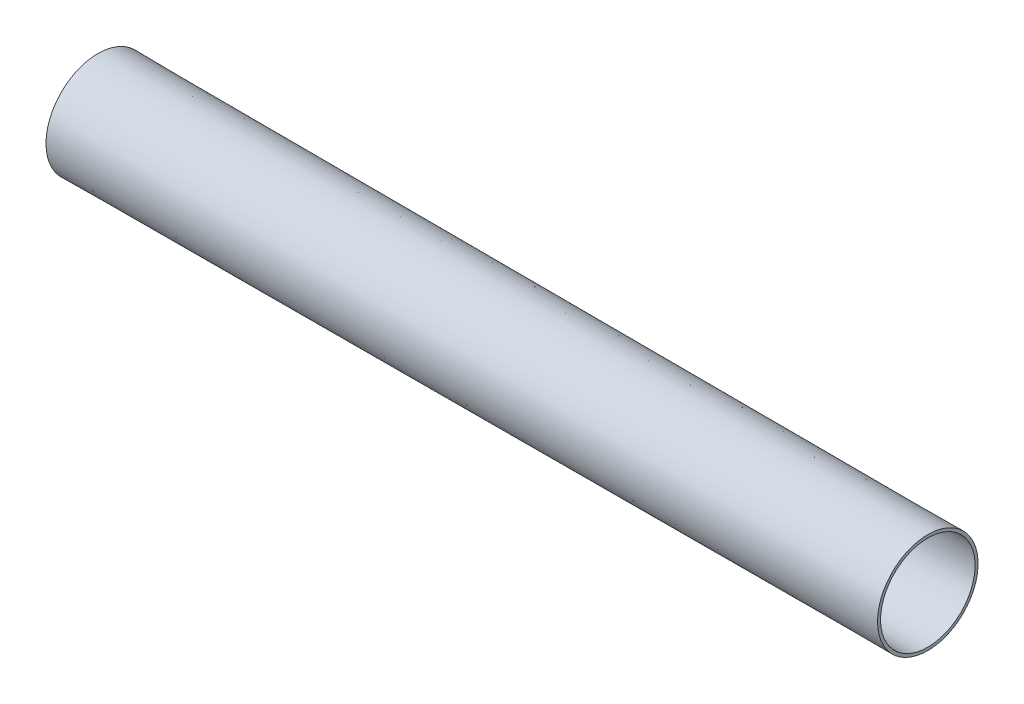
ISO-10303-21;
HEADER;
FILE_DESCRIPTION(('STEP AP214'),'2;1');
FILE_NAME('part.step','',(''),(''),'','','');
FILE_SCHEMA(('AUTOMOTIVE_DESIGN { 1 0 10303 214 1 1 1 1 }'));
ENDSEC;
DATA;
#1=APPLICATION_CONTEXT('core data for automotive mechanical design processes');
#2=APPLICATION_PROTOCOL_DEFINITION('international standard','automotive_design',2000,#1);
#3=PRODUCT_CONTEXT('',#1,'mechanical');
#4=PRODUCT('Part','Part','',(#3));
#5=PRODUCT_RELATED_PRODUCT_CATEGORY('part','',(#4));
#6=PRODUCT_DEFINITION_FORMATION('','',#4);
#7=PRODUCT_DEFINITION_CONTEXT('part definition',#1,'design');
#8=PRODUCT_DEFINITION('design','',#6,#7);
#9=PRODUCT_DEFINITION_SHAPE('','',#8);
#10=(LENGTH_UNIT() NAMED_UNIT(*) SI_UNIT(.MILLI.,.METRE.));
#11=(NAMED_UNIT(*) PLANE_ANGLE_UNIT() SI_UNIT($,.RADIAN.));
#12=(NAMED_UNIT(*) SI_UNIT($,.STERADIAN.) SOLID_ANGLE_UNIT());
#13=UNCERTAINTY_MEASURE_WITH_UNIT(LENGTH_MEASURE(1.E-05),#10,'distance_accuracy_value','');
#14=(GEOMETRIC_REPRESENTATION_CONTEXT(3) GLOBAL_UNCERTAINTY_ASSIGNED_CONTEXT((#13)) GLOBAL_UNIT_ASSIGNED_CONTEXT((#10,
#11,#12)) REPRESENTATION_CONTEXT('',''));
#15=CARTESIAN_POINT('',(0.,0.,0.));
#16=DIRECTION('',(0.,0.,1.));
#17=DIRECTION('',(1.,0.,0.));
#18=AXIS2_PLACEMENT_3D('',#15,#16,#17);
#19=CARTESIAN_POINT('',(19.05,0.,0.));
#20=DIRECTION('',(-1.,0.,0.));
#21=DIRECTION('',(0.,0.,1.));
#22=AXIS2_PLACEMENT_3D('',#19,#20,#21);
#23=CONICAL_SURFACE('',#22,16.4973,0.00206060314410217);
#24=CARTESIAN_POINT('',(298.45,0.,0.));
#25=DIRECTION('',(-1.,0.,0.));
#26=DIRECTION('',(0.,0.,1.));
#27=AXIS2_PLACEMENT_3D('',#24,#25,#26);
#28=CIRCLE('',#27,15.9215666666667);
#29=CARTESIAN_POINT('',(298.45,0.,15.9215666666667));
#30=VERTEX_POINT('',#29);
#31=EDGE_CURVE('E10',#30,#30,#28,.T.);
#32=ORIENTED_EDGE('',*,*,#31,.F.);
#33=EDGE_LOOP('',(#32));
#34=FACE_BOUND('',#33,.T.);
#35=CARTESIAN_POINT('',(19.05,0.,0.));
#36=DIRECTION('',(-1.,0.,0.));
#37=DIRECTION('',(0.,0.,1.));
#38=AXIS2_PLACEMENT_3D('',#35,#36,#37);
#39=CIRCLE('',#38,16.4973);
#40=CARTESIAN_POINT('',(19.05,0.,16.4973));
#41=VERTEX_POINT('',#40);
#42=EDGE_CURVE('E47',#41,#41,#39,.T.);
#43=ORIENTED_EDGE('',*,*,#42,.T.);
#44=EDGE_LOOP('',(#43));
#45=FACE_BOUND('',#44,.T.);
#46=ADVANCED_FACE('F33',(#34,#45),#23,.F.);
#47=CARTESIAN_POINT('',(298.45,15.9215666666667,0.));
#48=DIRECTION('',(-1.,0.,0.));
#49=DIRECTION('',(0.,0.,1.));
#50=AXIS2_PLACEMENT_3D('',#47,#48,#49);
#51=PLANE('',#50);
#52=CARTESIAN_POINT('',(298.45,0.,0.));
#53=DIRECTION('',(-1.,0.,0.));
#54=DIRECTION('',(0.,0.,1.));
#55=AXIS2_PLACEMENT_3D('',#52,#53,#54);
#56=CIRCLE('',#55,16.9291);
#57=CARTESIAN_POINT('',(298.45,0.,16.9291));
#58=VERTEX_POINT('',#57);
#59=EDGE_CURVE('E39',#58,#58,#56,.T.);
#60=ORIENTED_EDGE('',*,*,#59,.F.);
#61=EDGE_LOOP('',(#60));
#62=FACE_BOUND('',#61,.T.);
#63=ORIENTED_EDGE('',*,*,#31,.T.);
#64=EDGE_LOOP('',(#63));
#65=FACE_BOUND('',#64,.T.);
#66=ADVANCED_FACE('F62',(#62,#65),#51,.F.);
#67=CARTESIAN_POINT('',(298.45,0.,0.));
#68=DIRECTION('',(-1.,0.,0.));
#69=DIRECTION('',(0.,0.,1.));
#70=AXIS2_PLACEMENT_3D('',#67,#68,#69);
#71=CONICAL_SURFACE('',#70,16.9291,0.00206060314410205);
#72=CARTESIAN_POINT('',(19.05,0.,0.));
#73=DIRECTION('',(-1.,0.,0.));
#74=DIRECTION('',(0.,0.,1.));
#75=AXIS2_PLACEMENT_3D('',#72,#73,#74);
#76=CIRCLE('',#75,17.5048333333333);
#77=CARTESIAN_POINT('',(19.05,0.,17.5048333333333));
#78=VERTEX_POINT('',#77);
#79=EDGE_CURVE('E43',#78,#78,#76,.T.);
#80=ORIENTED_EDGE('',*,*,#79,.F.);
#81=EDGE_LOOP('',(#80));
#82=FACE_BOUND('',#81,.T.);
#83=ORIENTED_EDGE('',*,*,#59,.T.);
#84=EDGE_LOOP('',(#83));
#85=FACE_BOUND('',#84,.T.);
#86=ADVANCED_FACE('F57',(#82,#85),#71,.T.);
#87=CARTESIAN_POINT('',(19.05,17.5048333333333,0.));
#88=DIRECTION('',(1.,0.,0.));
#89=DIRECTION('',(0.,0.,-1.));
#90=AXIS2_PLACEMENT_3D('',#87,#88,#89);
#91=PLANE('',#90);
#92=ORIENTED_EDGE('',*,*,#42,.F.);
#93=EDGE_LOOP('',(#92));
#94=FACE_BOUND('',#93,.T.);
#95=ORIENTED_EDGE('',*,*,#79,.T.);
#96=EDGE_LOOP('',(#95));
#97=FACE_BOUND('',#96,.T.);
#98=ADVANCED_FACE('F54',(#94,#97),#91,.F.);
#99=CLOSED_SHELL('',(#46,#66,#86,#98));
#100=MANIFOLD_SOLID_BREP('B2',#99);
#101=ADVANCED_BREP_SHAPE_REPRESENTATION('',(#18,#100),#14);
#102=SHAPE_DEFINITION_REPRESENTATION(#9,#101);
ENDSEC;
END-ISO-10303-21;
